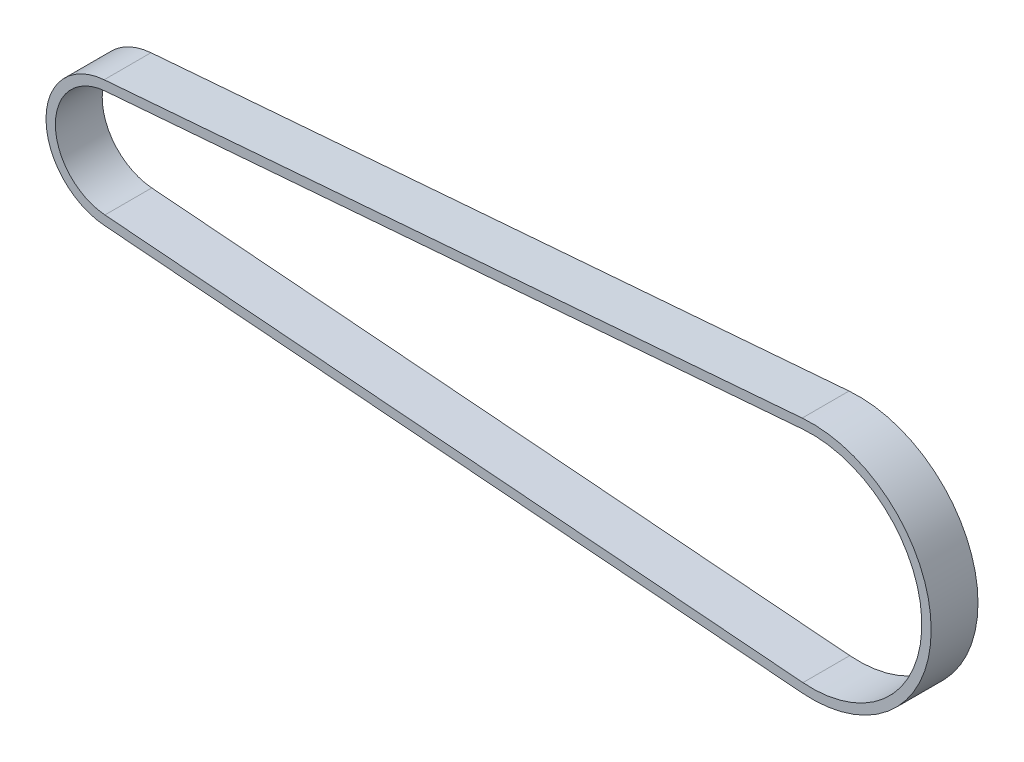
from build123d import *

# Parameters (mm, degrees)
EXTRUDE_1_DEPTH = 10


with BuildPart() as part:
    # Sketch 2 → Extrude 1 (new body)
    with BuildSketch(Plane.XY):
        with BuildLine():
            Line((-2.04, -25.418269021), (-151.08, -13.456730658))
            ThreePointArc((-151.08, -13.456730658), (-163.5, 0), (-151.08, 13.456730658))
            Line((-151.08, 13.456730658), (-2.04, 25.418269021))
            ThreePointArc((-2.04, 25.418269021), (25.5, 0), (-2.04, -25.418269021))
        make_face()
        with BuildLine():
            Line((-1.88, -23.424679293), (-150.92, -11.463140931))
            ThreePointArc((-150.92, -11.463140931), (-161.5, 0), (-150.92, 11.463140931))
            Line((-150.92, 11.463140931), (-1.88, 23.424679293))
            ThreePointArc((-1.88, 23.424679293), (23.5, 0), (-1.88, -23.424679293))
        make_face(mode=Mode.SUBTRACT)
    extrude(amount=EXTRUDE_1_DEPTH)


solid = part.part
